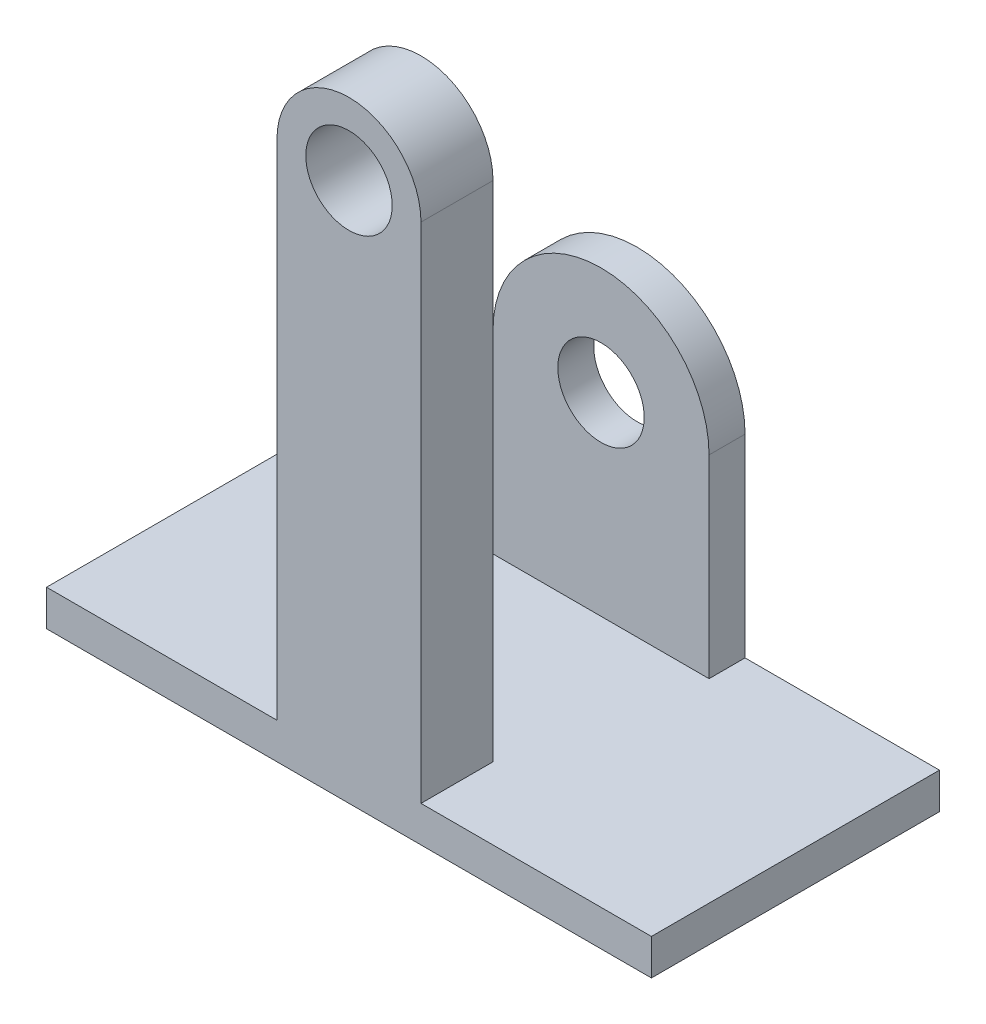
ISO-10303-21;
HEADER;
FILE_DESCRIPTION(('STEP AP214'),'2;1');
FILE_NAME('part.step','',(''),(''),'','','');
FILE_SCHEMA(('AUTOMOTIVE_DESIGN { 1 0 10303 214 1 1 1 1 }'));
ENDSEC;
DATA;
#1=APPLICATION_CONTEXT('core data for automotive mechanical design processes');
#2=APPLICATION_PROTOCOL_DEFINITION('international standard','automotive_design',2000,#1);
#3=PRODUCT_CONTEXT('',#1,'mechanical');
#4=PRODUCT('Part','Part','',(#3));
#5=PRODUCT_RELATED_PRODUCT_CATEGORY('part','',(#4));
#6=PRODUCT_DEFINITION_FORMATION('','',#4);
#7=PRODUCT_DEFINITION_CONTEXT('part definition',#1,'design');
#8=PRODUCT_DEFINITION('design','',#6,#7);
#9=PRODUCT_DEFINITION_SHAPE('','',#8);
#10=(LENGTH_UNIT() NAMED_UNIT(*) SI_UNIT(.MILLI.,.METRE.));
#11=(NAMED_UNIT(*) PLANE_ANGLE_UNIT() SI_UNIT($,.RADIAN.));
#12=(NAMED_UNIT(*) SI_UNIT($,.STERADIAN.) SOLID_ANGLE_UNIT());
#13=UNCERTAINTY_MEASURE_WITH_UNIT(LENGTH_MEASURE(1.E-05),#10,'distance_accuracy_value','');
#14=(GEOMETRIC_REPRESENTATION_CONTEXT(3) GLOBAL_UNCERTAINTY_ASSIGNED_CONTEXT((#13)) GLOBAL_UNIT_ASSIGNED_CONTEXT((#10,
#11,#12)) REPRESENTATION_CONTEXT('',''));
#15=CARTESIAN_POINT('',(0.,0.,0.));
#16=DIRECTION('',(0.,0.,1.));
#17=DIRECTION('',(1.,0.,0.));
#18=AXIS2_PLACEMENT_3D('',#15,#16,#17);
#19=CARTESIAN_POINT('',(0.,0.,10.));
#20=DIRECTION('',(0.,0.,1.));
#21=DIRECTION('',(1.,0.,0.));
#22=AXIS2_PLACEMENT_3D('',#19,#20,#21);
#23=PLANE('',#22);
#24=DIRECTION('',(0.,-1.,0.));
#25=VECTOR('',#24,1.);
#26=CARTESIAN_POINT('',(-10.,0.,10.));
#27=LINE('',#26,#25);
#28=CARTESIAN_POINT('',(-10.,0.,10.));
#29=VERTEX_POINT('',#28);
#30=CARTESIAN_POINT('',(-9.99999999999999,-69.911627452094,10.));
#31=VERTEX_POINT('',#30);
#32=EDGE_CURVE('E202',#29,#31,#27,.T.);
#33=ORIENTED_EDGE('',*,*,#32,.T.);
#34=DIRECTION('',(-1.,0.,0.));
#35=VECTOR('',#34,1.);
#36=CARTESIAN_POINT('',(-42.,-69.911627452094,10.));
#37=LINE('',#36,#35);
#38=CARTESIAN_POINT('',(-42.,-69.911627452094,10.));
#39=VERTEX_POINT('',#38);
#40=EDGE_CURVE('E174',#31,#39,#37,.T.);
#41=ORIENTED_EDGE('',*,*,#40,.T.);
#42=DIRECTION('',(0.,-1.,0.));
#43=VECTOR('',#42,1.);
#44=CARTESIAN_POINT('',(-42.,-74.911627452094,10.));
#45=LINE('',#44,#43);
#46=CARTESIAN_POINT('',(-42.,-74.911627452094,10.));
#47=VERTEX_POINT('',#46);
#48=EDGE_CURVE('E165',#39,#47,#45,.T.);
#49=ORIENTED_EDGE('',*,*,#48,.T.);
#50=DIRECTION('',(1.,0.,0.));
#51=VECTOR('',#50,1.);
#52=CARTESIAN_POINT('',(-42.,-74.911627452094,10.));
#53=LINE('',#52,#51);
#54=CARTESIAN_POINT('',(42.,-74.911627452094,10.));
#55=VERTEX_POINT('',#54);
#56=EDGE_CURVE('E168',#47,#55,#53,.T.);
#57=ORIENTED_EDGE('',*,*,#56,.T.);
#58=DIRECTION('',(0.,1.,0.));
#59=VECTOR('',#58,1.);
#60=CARTESIAN_POINT('',(42.,-74.911627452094,10.));
#61=LINE('',#60,#59);
#62=CARTESIAN_POINT('',(42.,-69.911627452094,10.));
#63=VERTEX_POINT('',#62);
#64=EDGE_CURVE('E171',#55,#63,#61,.T.);
#65=ORIENTED_EDGE('',*,*,#64,.T.);
#66=CARTESIAN_POINT('',(10.,-69.911627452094,10.));
#67=VERTEX_POINT('',#66);
#68=EDGE_CURVE('E175',#63,#67,#37,.T.);
#69=ORIENTED_EDGE('',*,*,#68,.T.);
#70=DIRECTION('',(0.,1.,0.));
#71=VECTOR('',#70,1.);
#72=CARTESIAN_POINT('',(10.,0.,10.));
#73=LINE('',#72,#71);
#74=CARTESIAN_POINT('',(10.,0.,10.));
#75=VERTEX_POINT('',#74);
#76=EDGE_CURVE('E57',#67,#75,#73,.T.);
#77=ORIENTED_EDGE('',*,*,#76,.T.);
#78=CARTESIAN_POINT('',(0.,0.,10.));
#79=DIRECTION('',(0.,0.,1.));
#80=DIRECTION('',(1.,0.,0.));
#81=AXIS2_PLACEMENT_3D('',#78,#79,#80);
#82=CIRCLE('',#81,10.);
#83=EDGE_CURVE('E42',#75,#29,#82,.T.);
#84=ORIENTED_EDGE('',*,*,#83,.T.);
#85=EDGE_LOOP('',(#33,#41,#49,#57,#65,#69,#77,#84));
#86=FACE_BOUND('',#85,.T.);
#87=CARTESIAN_POINT('',(0.,0.,10.));
#88=DIRECTION('',(0.,0.,1.));
#89=DIRECTION('',(1.,0.,0.));
#90=AXIS2_PLACEMENT_3D('',#87,#88,#89);
#91=CIRCLE('',#90,6.);
#92=CARTESIAN_POINT('',(6.,0.,10.));
#93=VERTEX_POINT('',#92);
#94=EDGE_CURVE('E219',#93,#93,#91,.T.);
#95=ORIENTED_EDGE('',*,*,#94,.F.);
#96=EDGE_LOOP('',(#95));
#97=FACE_BOUND('',#96,.T.);
#98=ADVANCED_FACE('F34',(#86,#97),#23,.T.);
#99=CARTESIAN_POINT('',(0.,0.,0.));
#100=DIRECTION('',(0.,0.,1.));
#101=DIRECTION('',(1.,0.,0.));
#102=AXIS2_PLACEMENT_3D('',#99,#100,#101);
#103=PLANE('',#102);
#104=DIRECTION('',(0.,1.,0.));
#105=VECTOR('',#104,1.);
#106=CARTESIAN_POINT('',(10.,0.,0.));
#107=LINE('',#106,#105);
#108=CARTESIAN_POINT('',(10.,-69.911627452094,0.));
#109=VERTEX_POINT('',#108);
#110=CARTESIAN_POINT('',(10.,0.,0.));
#111=VERTEX_POINT('',#110);
#112=EDGE_CURVE('E209',#109,#111,#107,.T.);
#113=ORIENTED_EDGE('',*,*,#112,.F.);
#114=DIRECTION('',(-1.,0.,0.));
#115=VECTOR('',#114,1.);
#116=CARTESIAN_POINT('',(0.,-69.911627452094,0.));
#117=LINE('',#116,#115);
#118=CARTESIAN_POINT('',(-9.99999999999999,-69.911627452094,0.));
#119=VERTEX_POINT('',#118);
#120=EDGE_CURVE('E192',#109,#119,#117,.T.);
#121=ORIENTED_EDGE('',*,*,#120,.T.);
#122=DIRECTION('',(0.,-1.,0.));
#123=VECTOR('',#122,1.);
#124=CARTESIAN_POINT('',(-10.,0.,0.));
#125=LINE('',#124,#123);
#126=CARTESIAN_POINT('',(-10.,0.,0.));
#127=VERTEX_POINT('',#126);
#128=EDGE_CURVE('E206',#127,#119,#125,.T.);
#129=ORIENTED_EDGE('',*,*,#128,.F.);
#130=CARTESIAN_POINT('',(0.,0.,0.));
#131=DIRECTION('',(0.,0.,1.));
#132=DIRECTION('',(1.,0.,0.));
#133=AXIS2_PLACEMENT_3D('',#130,#131,#132);
#134=CIRCLE('',#133,10.);
#135=EDGE_CURVE('E222',#111,#127,#134,.T.);
#136=ORIENTED_EDGE('',*,*,#135,.F.);
#137=EDGE_LOOP('',(#113,#121,#129,#136));
#138=FACE_BOUND('',#137,.T.);
#139=CARTESIAN_POINT('',(0.,0.,0.));
#140=DIRECTION('',(0.,0.,1.));
#141=DIRECTION('',(1.,0.,0.));
#142=AXIS2_PLACEMENT_3D('',#139,#140,#141);
#143=CIRCLE('',#142,6.);
#144=CARTESIAN_POINT('',(6.,0.,0.));
#145=VERTEX_POINT('',#144);
#146=EDGE_CURVE('E214',#145,#145,#143,.T.);
#147=ORIENTED_EDGE('',*,*,#146,.T.);
#148=EDGE_LOOP('',(#147));
#149=FACE_BOUND('',#148,.T.);
#150=ADVANCED_FACE('F235',(#138,#149),#103,.F.);
#151=CARTESIAN_POINT('',(0.,0.,10.));
#152=DIRECTION('',(0.,0.,-1.));
#153=DIRECTION('',(-1.,0.,0.));
#154=AXIS2_PLACEMENT_3D('',#151,#152,#153);
#155=CYLINDRICAL_SURFACE('',#154,10.);
#156=ORIENTED_EDGE('',*,*,#83,.F.);
#157=DIRECTION('',(0.,0.,1.));
#158=VECTOR('',#157,1.);
#159=CARTESIAN_POINT('',(10.,0.,0.));
#160=LINE('',#159,#158);
#161=EDGE_CURVE('E212',#111,#75,#160,.T.);
#162=ORIENTED_EDGE('',*,*,#161,.F.);
#163=ORIENTED_EDGE('',*,*,#135,.T.);
#164=DIRECTION('',(0.,0.,1.));
#165=VECTOR('',#164,1.);
#166=CARTESIAN_POINT('',(-10.,0.,0.));
#167=LINE('',#166,#165);
#168=EDGE_CURVE('E211',#127,#29,#167,.T.);
#169=ORIENTED_EDGE('',*,*,#168,.T.);
#170=EDGE_LOOP('',(#156,#162,#163,#169));
#171=FACE_BOUND('',#170,.T.);
#172=ADVANCED_FACE('F36',(#171),#155,.T.);
#173=CARTESIAN_POINT('',(0.,0.,10.));
#174=DIRECTION('',(0.,0.,-1.));
#175=DIRECTION('',(-1.,0.,0.));
#176=AXIS2_PLACEMENT_3D('',#173,#174,#175);
#177=CYLINDRICAL_SURFACE('',#176,6.);
#178=ORIENTED_EDGE('',*,*,#94,.T.);
#179=EDGE_LOOP('',(#178));
#180=FACE_BOUND('',#179,.T.);
#181=ORIENTED_EDGE('',*,*,#146,.F.);
#182=EDGE_LOOP('',(#181));
#183=FACE_BOUND('',#182,.T.);
#184=ADVANCED_FACE('F244',(#180,#183),#177,.F.);
#185=CARTESIAN_POINT('',(10.,0.,0.));
#186=DIRECTION('',(1.,0.,0.));
#187=DIRECTION('',(0.,1.,0.));
#188=AXIS2_PLACEMENT_3D('',#185,#186,#187);
#189=PLANE('',#188);
#190=DIRECTION('',(0.,0.,1.));
#191=VECTOR('',#190,1.);
#192=CARTESIAN_POINT('',(10.,-69.911627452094,0.));
#193=LINE('',#192,#191);
#194=EDGE_CURVE('E200',#109,#67,#193,.T.);
#195=ORIENTED_EDGE('',*,*,#194,.F.);
#196=ORIENTED_EDGE('',*,*,#112,.T.);
#197=ORIENTED_EDGE('',*,*,#161,.T.);
#198=ORIENTED_EDGE('',*,*,#76,.F.);
#199=EDGE_LOOP('',(#195,#196,#197,#198));
#200=FACE_BOUND('',#199,.T.);
#201=ADVANCED_FACE('F242',(#200),#189,.T.);
#202=CARTESIAN_POINT('',(-10.,0.,0.));
#203=DIRECTION('',(-1.,0.,0.));
#204=DIRECTION('',(0.,-1.,0.));
#205=AXIS2_PLACEMENT_3D('',#202,#203,#204);
#206=PLANE('',#205);
#207=DIRECTION('',(0.,0.,-1.));
#208=VECTOR('',#207,1.);
#209=CARTESIAN_POINT('',(-9.99999999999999,-69.911627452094,0.));
#210=LINE('',#209,#208);
#211=EDGE_CURVE('E11',#31,#119,#210,.T.);
#212=ORIENTED_EDGE('',*,*,#211,.F.);
#213=ORIENTED_EDGE('',*,*,#32,.F.);
#214=ORIENTED_EDGE('',*,*,#168,.F.);
#215=ORIENTED_EDGE('',*,*,#128,.T.);
#216=EDGE_LOOP('',(#212,#213,#214,#215));
#217=FACE_BOUND('',#216,.T.);
#218=ADVANCED_FACE('F232',(#217),#206,.T.);
#219=CARTESIAN_POINT('',(-42.,-74.911627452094,-30.));
#220=DIRECTION('',(-1.,0.,0.));
#221=DIRECTION('',(0.,-1.,0.));
#222=AXIS2_PLACEMENT_3D('',#219,#220,#221);
#223=PLANE('',#222);
#224=ORIENTED_EDGE('',*,*,#48,.F.);
#225=DIRECTION('',(0.,0.,1.));
#226=VECTOR('',#225,1.);
#227=CARTESIAN_POINT('',(-42.,-69.911627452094,-30.));
#228=LINE('',#227,#226);
#229=CARTESIAN_POINT('',(-42.,-69.911627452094,-30.));
#230=VERTEX_POINT('',#229);
#231=EDGE_CURVE('E189',#230,#39,#228,.T.);
#232=ORIENTED_EDGE('',*,*,#231,.F.);
#233=DIRECTION('',(0.,-1.,0.));
#234=VECTOR('',#233,1.);
#235=CARTESIAN_POINT('',(-42.,-74.911627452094,-30.));
#236=LINE('',#235,#234);
#237=CARTESIAN_POINT('',(-42.,-74.911627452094,-30.));
#238=VERTEX_POINT('',#237);
#239=EDGE_CURVE('E177',#230,#238,#236,.T.);
#240=ORIENTED_EDGE('',*,*,#239,.T.);
#241=DIRECTION('',(0.,0.,1.));
#242=VECTOR('',#241,1.);
#243=CARTESIAN_POINT('',(-42.,-74.911627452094,-30.));
#244=LINE('',#243,#242);
#245=EDGE_CURVE('E188',#238,#47,#244,.T.);
#246=ORIENTED_EDGE('',*,*,#245,.T.);
#247=EDGE_LOOP('',(#224,#232,#240,#246));
#248=FACE_BOUND('',#247,.T.);
#249=ADVANCED_FACE('F250',(#248),#223,.T.);
#250=CARTESIAN_POINT('',(-42.,-69.911627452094,-30.));
#251=DIRECTION('',(0.,1.,0.));
#252=DIRECTION('',(0.,0.,1.));
#253=AXIS2_PLACEMENT_3D('',#250,#251,#252);
#254=PLANE('',#253);
#255=DIRECTION('',(0.,0.,1.));
#256=VECTOR('',#255,1.);
#257=CARTESIAN_POINT('',(-14.9962677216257,-69.911627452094,-30.));
#258=LINE('',#257,#256);
#259=CARTESIAN_POINT('',(-14.9962677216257,-69.911627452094,-30.));
#260=VERTEX_POINT('',#259);
#261=CARTESIAN_POINT('',(-14.9962677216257,-69.911627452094,-25.));
#262=VERTEX_POINT('',#261);
#263=EDGE_CURVE('E160',#260,#262,#258,.T.);
#264=ORIENTED_EDGE('',*,*,#263,.F.);
#265=DIRECTION('',(-1.,0.,0.));
#266=VECTOR('',#265,1.);
#267=CARTESIAN_POINT('',(-42.,-69.911627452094,-30.));
#268=LINE('',#267,#266);
#269=EDGE_CURVE('E134',#260,#230,#268,.T.);
#270=ORIENTED_EDGE('',*,*,#269,.T.);
#271=ORIENTED_EDGE('',*,*,#231,.T.);
#272=ORIENTED_EDGE('',*,*,#40,.F.);
#273=ORIENTED_EDGE('',*,*,#211,.T.);
#274=ORIENTED_EDGE('',*,*,#120,.F.);
#275=ORIENTED_EDGE('',*,*,#194,.T.);
#276=ORIENTED_EDGE('',*,*,#68,.F.);
#277=DIRECTION('',(0.,0.,1.));
#278=VECTOR('',#277,1.);
#279=CARTESIAN_POINT('',(42.,-69.911627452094,-30.));
#280=LINE('',#279,#278);
#281=CARTESIAN_POINT('',(42.,-69.911627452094,-30.));
#282=VERTEX_POINT('',#281);
#283=EDGE_CURVE('E193',#282,#63,#280,.T.);
#284=ORIENTED_EDGE('',*,*,#283,.F.);
#285=CARTESIAN_POINT('',(15.0037322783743,-69.911627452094,-30.));
#286=VERTEX_POINT('',#285);
#287=EDGE_CURVE('E185',#282,#286,#268,.T.);
#288=ORIENTED_EDGE('',*,*,#287,.T.);
#289=DIRECTION('',(0.,0.,-1.));
#290=VECTOR('',#289,1.);
#291=CARTESIAN_POINT('',(15.0037322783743,-69.911627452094,-30.));
#292=LINE('',#291,#290);
#293=CARTESIAN_POINT('',(15.0037322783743,-69.911627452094,-25.));
#294=VERTEX_POINT('',#293);
#295=EDGE_CURVE('E158',#294,#286,#292,.T.);
#296=ORIENTED_EDGE('',*,*,#295,.F.);
#297=DIRECTION('',(-1.,0.,0.));
#298=VECTOR('',#297,1.);
#299=CARTESIAN_POINT('',(-42.,-69.911627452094,-25.));
#300=LINE('',#299,#298);
#301=EDGE_CURVE('E162',#294,#262,#300,.T.);
#302=ORIENTED_EDGE('',*,*,#301,.T.);
#303=EDGE_LOOP('',(#264,#270,#271,#272,#273,#274,#275,#276,#284,#288,#296,#302));
#304=FACE_BOUND('',#303,.T.);
#305=ADVANCED_FACE('F239',(#304),#254,.T.);
#306=CARTESIAN_POINT('',(42.,-74.911627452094,-30.));
#307=DIRECTION('',(1.,0.,0.));
#308=DIRECTION('',(0.,1.,0.));
#309=AXIS2_PLACEMENT_3D('',#306,#307,#308);
#310=PLANE('',#309);
#311=ORIENTED_EDGE('',*,*,#64,.F.);
#312=DIRECTION('',(0.,0.,1.));
#313=VECTOR('',#312,1.);
#314=CARTESIAN_POINT('',(42.,-74.911627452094,-30.));
#315=LINE('',#314,#313);
#316=CARTESIAN_POINT('',(42.,-74.911627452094,-30.));
#317=VERTEX_POINT('',#316);
#318=EDGE_CURVE('E195',#317,#55,#315,.T.);
#319=ORIENTED_EDGE('',*,*,#318,.F.);
#320=DIRECTION('',(0.,1.,0.));
#321=VECTOR('',#320,1.);
#322=CARTESIAN_POINT('',(42.,-74.911627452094,-30.));
#323=LINE('',#322,#321);
#324=EDGE_CURVE('E182',#317,#282,#323,.T.);
#325=ORIENTED_EDGE('',*,*,#324,.T.);
#326=ORIENTED_EDGE('',*,*,#283,.T.);
#327=EDGE_LOOP('',(#311,#319,#325,#326));
#328=FACE_BOUND('',#327,.T.);
#329=ADVANCED_FACE('F312',(#328),#310,.T.);
#330=CARTESIAN_POINT('',(-42.,-74.911627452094,-30.));
#331=DIRECTION('',(0.,-1.,0.));
#332=DIRECTION('',(0.,0.,-1.));
#333=AXIS2_PLACEMENT_3D('',#330,#331,#332);
#334=PLANE('',#333);
#335=DIRECTION('',(1.,0.,0.));
#336=VECTOR('',#335,1.);
#337=CARTESIAN_POINT('',(-42.,-74.911627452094,-30.));
#338=LINE('',#337,#336);
#339=EDGE_CURVE('E180',#238,#317,#338,.T.);
#340=ORIENTED_EDGE('',*,*,#339,.T.);
#341=ORIENTED_EDGE('',*,*,#318,.T.);
#342=ORIENTED_EDGE('',*,*,#56,.F.);
#343=ORIENTED_EDGE('',*,*,#245,.F.);
#344=EDGE_LOOP('',(#340,#341,#342,#343));
#345=FACE_BOUND('',#344,.T.);
#346=ADVANCED_FACE('F317',(#345),#334,.T.);
#347=CARTESIAN_POINT('',(-42.,-69.911627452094,-30.));
#348=DIRECTION('',(0.,0.,-1.));
#349=DIRECTION('',(-1.,0.,0.));
#350=AXIS2_PLACEMENT_3D('',#347,#348,#349);
#351=PLANE('',#350);
#352=ORIENTED_EDGE('',*,*,#324,.F.);
#353=ORIENTED_EDGE('',*,*,#339,.F.);
#354=ORIENTED_EDGE('',*,*,#239,.F.);
#355=ORIENTED_EDGE('',*,*,#269,.F.);
#356=DIRECTION('',(0.,1.,0.));
#357=VECTOR('',#356,1.);
#358=CARTESIAN_POINT('',(-14.9962677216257,-43.,-30.));
#359=LINE('',#358,#357);
#360=CARTESIAN_POINT('',(-14.9962677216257,-43.,-30.));
#361=VERTEX_POINT('',#360);
#362=EDGE_CURVE('E124',#260,#361,#359,.T.);
#363=ORIENTED_EDGE('',*,*,#362,.T.);
#364=CARTESIAN_POINT('',(0.00373227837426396,-43.,-30.));
#365=DIRECTION('',(0.,0.,-1.));
#366=DIRECTION('',(-1.,0.,0.));
#367=AXIS2_PLACEMENT_3D('',#364,#365,#366);
#368=CIRCLE('',#367,15.);
#369=CARTESIAN_POINT('',(15.0037322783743,-43.,-30.));
#370=VERTEX_POINT('',#369);
#371=EDGE_CURVE('E131',#361,#370,#368,.T.);
#372=ORIENTED_EDGE('',*,*,#371,.T.);
#373=DIRECTION('',(0.,-1.,0.));
#374=VECTOR('',#373,1.);
#375=CARTESIAN_POINT('',(15.0037322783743,-43.,-30.));
#376=LINE('',#375,#374);
#377=EDGE_CURVE('E145',#370,#286,#376,.T.);
#378=ORIENTED_EDGE('',*,*,#377,.T.);
#379=ORIENTED_EDGE('',*,*,#287,.F.);
#380=EDGE_LOOP('',(#352,#353,#354,#355,#363,#372,#378,#379));
#381=FACE_BOUND('',#380,.T.);
#382=CARTESIAN_POINT('',(0.,-43.,-30.));
#383=DIRECTION('',(0.,0.,-1.));
#384=DIRECTION('',(-1.,0.,0.));
#385=AXIS2_PLACEMENT_3D('',#382,#383,#384);
#386=CIRCLE('',#385,6.);
#387=CARTESIAN_POINT('',(-6.00000000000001,-43.,-30.));
#388=VERTEX_POINT('',#387);
#389=EDGE_CURVE('E137',#388,#388,#386,.T.);
#390=ORIENTED_EDGE('',*,*,#389,.F.);
#391=EDGE_LOOP('',(#390));
#392=FACE_BOUND('',#391,.T.);
#393=ADVANCED_FACE('F127',(#381,#392),#351,.T.);
#394=CARTESIAN_POINT('',(-14.9962677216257,-43.,30.6839365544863));
#395=DIRECTION('',(-1.,0.,0.));
#396=DIRECTION('',(0.,0.,1.));
#397=AXIS2_PLACEMENT_3D('',#394,#395,#396);
#398=PLANE('',#397);
#399=ORIENTED_EDGE('',*,*,#362,.F.);
#400=ORIENTED_EDGE('',*,*,#263,.T.);
#401=DIRECTION('',(0.,-1.,0.));
#402=VECTOR('',#401,1.);
#403=CARTESIAN_POINT('',(-14.9962677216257,-43.,-25.));
#404=LINE('',#403,#402);
#405=CARTESIAN_POINT('',(-14.9962677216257,-43.,-25.));
#406=VERTEX_POINT('',#405);
#407=EDGE_CURVE('E49',#406,#262,#404,.T.);
#408=ORIENTED_EDGE('',*,*,#407,.F.);
#409=DIRECTION('',(0.,0.,-1.));
#410=VECTOR('',#409,1.);
#411=CARTESIAN_POINT('',(-14.9962677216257,-43.,30.6839365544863));
#412=LINE('',#411,#410);
#413=EDGE_CURVE('E140',#406,#361,#412,.T.);
#414=ORIENTED_EDGE('',*,*,#413,.T.);
#415=EDGE_LOOP('',(#399,#400,#408,#414));
#416=FACE_BOUND('',#415,.T.);
#417=ADVANCED_FACE('F141',(#416),#398,.T.);
#418=CARTESIAN_POINT('',(0.00373227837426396,-43.,30.6839365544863));
#419=DIRECTION('',(0.,0.,-1.));
#420=DIRECTION('',(-1.,0.,0.));
#421=AXIS2_PLACEMENT_3D('',#418,#419,#420);
#422=CYLINDRICAL_SURFACE('',#421,15.);
#423=CARTESIAN_POINT('',(0.00373227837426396,-43.,-25.));
#424=DIRECTION('',(0.,0.,-1.));
#425=DIRECTION('',(0.,1.,0.));
#426=AXIS2_PLACEMENT_3D('',#423,#424,#425);
#427=CIRCLE('',#426,15.);
#428=CARTESIAN_POINT('',(15.0037322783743,-43.,-25.));
#429=VERTEX_POINT('',#428);
#430=EDGE_CURVE('E153',#429,#406,#427,.F.);
#431=ORIENTED_EDGE('',*,*,#430,.F.);
#432=DIRECTION('',(0.,0.,-1.));
#433=VECTOR('',#432,1.);
#434=CARTESIAN_POINT('',(15.0037322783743,-43.,30.6839365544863));
#435=LINE('',#434,#433);
#436=EDGE_CURVE('E144',#429,#370,#435,.T.);
#437=ORIENTED_EDGE('',*,*,#436,.T.);
#438=ORIENTED_EDGE('',*,*,#371,.F.);
#439=ORIENTED_EDGE('',*,*,#413,.F.);
#440=EDGE_LOOP('',(#431,#437,#438,#439));
#441=FACE_BOUND('',#440,.T.);
#442=ADVANCED_FACE('F147',(#441),#422,.T.);
#443=CARTESIAN_POINT('',(15.0037322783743,-43.,30.6839365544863));
#444=DIRECTION('',(1.,0.,0.));
#445=DIRECTION('',(0.,1.,0.));
#446=AXIS2_PLACEMENT_3D('',#443,#444,#445);
#447=PLANE('',#446);
#448=DIRECTION('',(0.,1.,0.));
#449=VECTOR('',#448,1.);
#450=CARTESIAN_POINT('',(15.0037322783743,-43.,-25.));
#451=LINE('',#450,#449);
#452=EDGE_CURVE('E398',#294,#429,#451,.T.);
#453=ORIENTED_EDGE('',*,*,#452,.F.);
#454=ORIENTED_EDGE('',*,*,#295,.T.);
#455=ORIENTED_EDGE('',*,*,#377,.F.);
#456=ORIENTED_EDGE('',*,*,#436,.F.);
#457=EDGE_LOOP('',(#453,#454,#455,#456));
#458=FACE_BOUND('',#457,.T.);
#459=ADVANCED_FACE('F359',(#458),#447,.T.);
#460=CARTESIAN_POINT('',(0.,-43.,30.6839365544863));
#461=DIRECTION('',(0.,0.,-1.));
#462=DIRECTION('',(-1.,0.,0.));
#463=AXIS2_PLACEMENT_3D('',#460,#461,#462);
#464=CYLINDRICAL_SURFACE('',#463,6.);
#465=CARTESIAN_POINT('',(0.,-43.,-25.));
#466=DIRECTION('',(0.,0.,-1.));
#467=DIRECTION('',(0.,1.,0.));
#468=AXIS2_PLACEMENT_3D('',#465,#466,#467);
#469=CIRCLE('',#468,6.);
#470=CARTESIAN_POINT('',(0.,-37.,-25.));
#471=VERTEX_POINT('',#470);
#472=EDGE_CURVE('E155',#471,#471,#469,.F.);
#473=ORIENTED_EDGE('',*,*,#472,.T.);
#474=EDGE_LOOP('',(#473));
#475=FACE_BOUND('',#474,.T.);
#476=ORIENTED_EDGE('',*,*,#389,.T.);
#477=EDGE_LOOP('',(#476));
#478=FACE_BOUND('',#477,.T.);
#479=ADVANCED_FACE('F368',(#475,#478),#464,.F.);
#480=CARTESIAN_POINT('',(0.,0.,-25.));
#481=DIRECTION('',(0.,0.,-1.));
#482=DIRECTION('',(-0.404480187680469,-0.914546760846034,0.));
#483=AXIS2_PLACEMENT_3D('',#480,#481,#482);
#484=PLANE('',#483);
#485=ORIENTED_EDGE('',*,*,#301,.F.);
#486=ORIENTED_EDGE('',*,*,#452,.T.);
#487=ORIENTED_EDGE('',*,*,#430,.T.);
#488=ORIENTED_EDGE('',*,*,#407,.T.);
#489=EDGE_LOOP('',(#485,#486,#487,#488));
#490=FACE_BOUND('',#489,.T.);
#491=ORIENTED_EDGE('',*,*,#472,.F.);
#492=EDGE_LOOP('',(#491));
#493=FACE_BOUND('',#492,.T.);
#494=ADVANCED_FACE('F378',(#490,#493),#484,.F.);
#495=CLOSED_SHELL('',(#98,#150,#172,#184,#201,#218,#249,#305,#329,#346,#393,#417,#442,#459,#479,#494));
#496=MANIFOLD_SOLID_BREP('B2',#495);
#497=ADVANCED_BREP_SHAPE_REPRESENTATION('',(#18,#496),#14);
#498=SHAPE_DEFINITION_REPRESENTATION(#9,#497);
ENDSEC;
END-ISO-10303-21;
